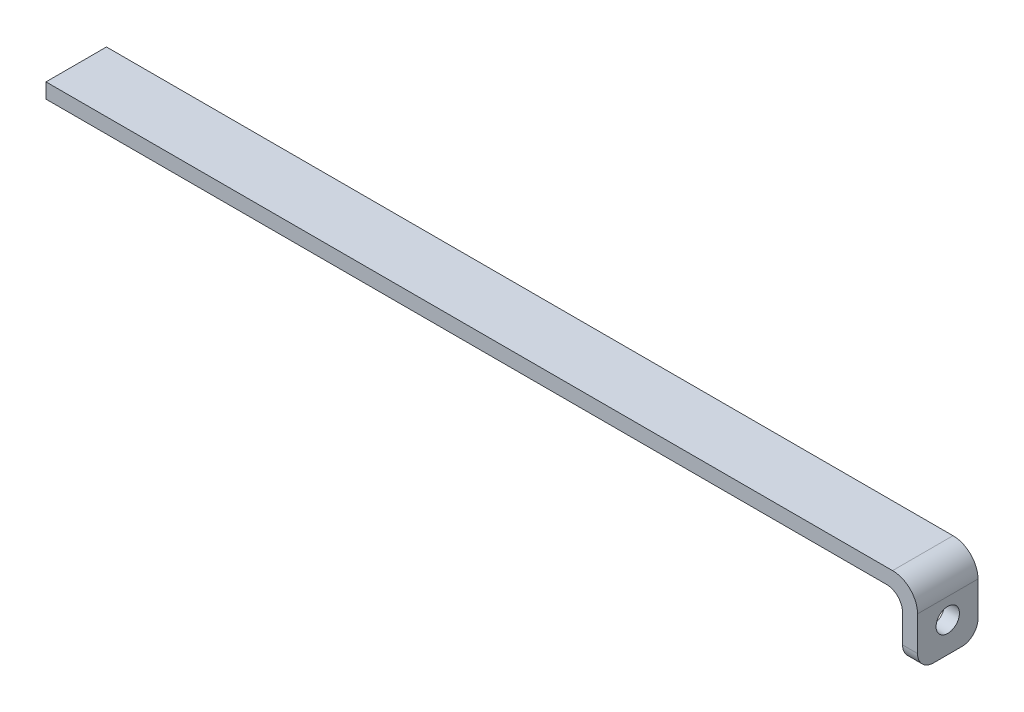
ISO-10303-21;
HEADER;
FILE_DESCRIPTION(('STEP AP214'),'2;1');
FILE_NAME('part.step','',(''),(''),'','','');
FILE_SCHEMA(('AUTOMOTIVE_DESIGN { 1 0 10303 214 1 1 1 1 }'));
ENDSEC;
DATA;
#1=APPLICATION_CONTEXT('core data for automotive mechanical design processes');
#2=APPLICATION_PROTOCOL_DEFINITION('international standard','automotive_design',2000,#1);
#3=PRODUCT_CONTEXT('',#1,'mechanical');
#4=PRODUCT('Part','Part','',(#3));
#5=PRODUCT_RELATED_PRODUCT_CATEGORY('part','',(#4));
#6=PRODUCT_DEFINITION_FORMATION('','',#4);
#7=PRODUCT_DEFINITION_CONTEXT('part definition',#1,'design');
#8=PRODUCT_DEFINITION('design','',#6,#7);
#9=PRODUCT_DEFINITION_SHAPE('','',#8);
#10=(LENGTH_UNIT() NAMED_UNIT(*) SI_UNIT(.MILLI.,.METRE.));
#11=(NAMED_UNIT(*) PLANE_ANGLE_UNIT() SI_UNIT($,.RADIAN.));
#12=(NAMED_UNIT(*) SI_UNIT($,.STERADIAN.) SOLID_ANGLE_UNIT());
#13=UNCERTAINTY_MEASURE_WITH_UNIT(LENGTH_MEASURE(1.E-05),#10,'distance_accuracy_value','');
#14=(GEOMETRIC_REPRESENTATION_CONTEXT(3) GLOBAL_UNCERTAINTY_ASSIGNED_CONTEXT((#13)) GLOBAL_UNIT_ASSIGNED_CONTEXT((#10,
#11,#12)) REPRESENTATION_CONTEXT('',''));
#15=CARTESIAN_POINT('',(0.,0.,0.));
#16=DIRECTION('',(0.,0.,1.));
#17=DIRECTION('',(1.,0.,0.));
#18=AXIS2_PLACEMENT_3D('',#15,#16,#17);
#19=CARTESIAN_POINT('',(-4.7625,-2.3622,4.7625));
#20=DIRECTION('',(-1.,0.,0.));
#21=DIRECTION('',(0.,0.,1.));
#22=AXIS2_PLACEMENT_3D('',#19,#20,#21);
#23=PLANE('',#22);
#24=DIRECTION('',(0.,0.,1.));
#25=VECTOR('',#24,1.);
#26=CARTESIAN_POINT('',(-4.7625,0.,4.7625));
#27=LINE('',#26,#25);
#28=CARTESIAN_POINT('',(-4.7625,0.,-4.7625));
#29=VERTEX_POINT('',#28);
#30=CARTESIAN_POINT('',(-4.7625,0.,4.7625));
#31=VERTEX_POINT('',#30);
#32=EDGE_CURVE('E141',#29,#31,#27,.T.);
#33=ORIENTED_EDGE('',*,*,#32,.F.);
#34=DIRECTION('',(0.,1.,0.));
#35=VECTOR('',#34,1.);
#36=CARTESIAN_POINT('',(-4.7625,-2.3622,-4.7625));
#37=LINE('',#36,#35);
#38=CARTESIAN_POINT('',(-4.7625,-2.3622,-4.7625));
#39=VERTEX_POINT('',#38);
#40=EDGE_CURVE('E120',#39,#29,#37,.T.);
#41=ORIENTED_EDGE('',*,*,#40,.F.);
#42=DIRECTION('',(0.,0.,1.));
#43=VECTOR('',#42,1.);
#44=CARTESIAN_POINT('',(-4.7625,-2.3622,4.7625));
#45=LINE('',#44,#43);
#46=CARTESIAN_POINT('',(-4.7625,-2.3622,4.7625));
#47=VERTEX_POINT('',#46);
#48=EDGE_CURVE('E127',#39,#47,#45,.T.);
#49=ORIENTED_EDGE('',*,*,#48,.T.);
#50=DIRECTION('',(0.,1.,0.));
#51=VECTOR('',#50,1.);
#52=CARTESIAN_POINT('',(-4.7625,-2.3622,4.7625));
#53=LINE('',#52,#51);
#54=EDGE_CURVE('E110',#47,#31,#53,.T.);
#55=ORIENTED_EDGE('',*,*,#54,.T.);
#56=EDGE_LOOP('',(#33,#41,#49,#55));
#57=FACE_BOUND('',#56,.T.);
#58=ADVANCED_FACE('F36',(#57),#23,.T.);
#59=CARTESIAN_POINT('',(-4.7625,-2.3622,-4.7625));
#60=DIRECTION('',(0.,0.,-1.));
#61=DIRECTION('',(-1.,0.,0.));
#62=AXIS2_PLACEMENT_3D('',#59,#60,#61);
#63=PLANE('',#62);
#64=DIRECTION('',(-1.,0.,0.));
#65=VECTOR('',#64,1.);
#66=CARTESIAN_POINT('',(-4.7625,0.,-4.7625));
#67=LINE('',#66,#65);
#68=CARTESIAN_POINT('',(128.5875,0.,-4.7625));
#69=VERTEX_POINT('',#68);
#70=EDGE_CURVE('E133',#69,#29,#67,.T.);
#71=ORIENTED_EDGE('',*,*,#70,.F.);
#72=CARTESIAN_POINT('',(128.5875,-3.937,-4.7625));
#73=DIRECTION('',(0.,0.,-1.));
#74=DIRECTION('',(-1.,0.,0.));
#75=AXIS2_PLACEMENT_3D('',#72,#73,#74);
#76=CIRCLE('',#75,3.937);
#77=CARTESIAN_POINT('',(132.5245,-3.937,-4.7625));
#78=VERTEX_POINT('',#77);
#79=EDGE_CURVE('E11',#69,#78,#76,.T.);
#80=ORIENTED_EDGE('',*,*,#79,.T.);
#81=DIRECTION('',(0.,1.,0.));
#82=VECTOR('',#81,1.);
#83=CARTESIAN_POINT('',(132.5245,0.,-4.7625));
#84=LINE('',#83,#82);
#85=CARTESIAN_POINT('',(132.5245,-9.3472,-4.7625));
#86=VERTEX_POINT('',#85);
#87=EDGE_CURVE('E143',#86,#78,#84,.T.);
#88=ORIENTED_EDGE('',*,*,#87,.F.);
#89=DIRECTION('',(-1.,0.,0.));
#90=VECTOR('',#89,1.);
#91=CARTESIAN_POINT('',(130.1623,-9.3472,-4.7625));
#92=LINE('',#91,#90);
#93=CARTESIAN_POINT('',(130.1623,-9.3472,-4.7625));
#94=VERTEX_POINT('',#93);
#95=EDGE_CURVE('E145',#86,#94,#92,.T.);
#96=ORIENTED_EDGE('',*,*,#95,.T.);
#97=DIRECTION('',(0.,1.,0.));
#98=VECTOR('',#97,1.);
#99=CARTESIAN_POINT('',(130.1623,0.,-4.7625));
#100=LINE('',#99,#98);
#101=CARTESIAN_POINT('',(130.1623,-4.9022,-4.7625));
#102=VERTEX_POINT('',#101);
#103=EDGE_CURVE('E137',#94,#102,#100,.T.);
#104=ORIENTED_EDGE('',*,*,#103,.T.);
#105=CARTESIAN_POINT('',(127.6223,-4.9022,-4.7625));
#106=DIRECTION('',(0.,0.,-1.));
#107=DIRECTION('',(-1.,0.,0.));
#108=AXIS2_PLACEMENT_3D('',#105,#106,#107);
#109=CIRCLE('',#108,2.54);
#110=CARTESIAN_POINT('',(127.6223,-2.3622,-4.7625));
#111=VERTEX_POINT('',#110);
#112=EDGE_CURVE('E169',#102,#111,#109,.F.);
#113=ORIENTED_EDGE('',*,*,#112,.T.);
#114=DIRECTION('',(-1.,0.,0.));
#115=VECTOR('',#114,1.);
#116=CARTESIAN_POINT('',(-4.7625,-2.3622,-4.7625));
#117=LINE('',#116,#115);
#118=EDGE_CURVE('E121',#111,#39,#117,.T.);
#119=ORIENTED_EDGE('',*,*,#118,.T.);
#120=ORIENTED_EDGE('',*,*,#40,.T.);
#121=EDGE_LOOP('',(#71,#80,#88,#96,#104,#113,#119,#120));
#122=FACE_BOUND('',#121,.T.);
#123=ADVANCED_FACE('F212',(#122),#63,.T.);
#124=CARTESIAN_POINT('',(-4.7625,-2.3622,4.7625));
#125=DIRECTION('',(0.,0.,1.));
#126=DIRECTION('',(1.,0.,0.));
#127=AXIS2_PLACEMENT_3D('',#124,#125,#126);
#128=PLANE('',#127);
#129=DIRECTION('',(0.,-1.,0.));
#130=VECTOR('',#129,1.);
#131=CARTESIAN_POINT('',(132.5245,0.,4.7625));
#132=LINE('',#131,#130);
#133=CARTESIAN_POINT('',(132.5245,-3.937,4.7625));
#134=VERTEX_POINT('',#133);
#135=CARTESIAN_POINT('',(132.5245,-9.3472,4.7625));
#136=VERTEX_POINT('',#135);
#137=EDGE_CURVE('E180',#134,#136,#132,.T.);
#138=ORIENTED_EDGE('',*,*,#137,.F.);
#139=CARTESIAN_POINT('',(128.5875,-3.937,4.7625));
#140=DIRECTION('',(0.,0.,1.));
#141=DIRECTION('',(1.,0.,0.));
#142=AXIS2_PLACEMENT_3D('',#139,#140,#141);
#143=CIRCLE('',#142,3.937);
#144=CARTESIAN_POINT('',(128.5875,0.,4.7625));
#145=VERTEX_POINT('',#144);
#146=EDGE_CURVE('E58',#134,#145,#143,.T.);
#147=ORIENTED_EDGE('',*,*,#146,.T.);
#148=DIRECTION('',(1.,0.,0.));
#149=VECTOR('',#148,1.);
#150=CARTESIAN_POINT('',(-4.7625,0.,4.7625));
#151=LINE('',#150,#149);
#152=EDGE_CURVE('E115',#31,#145,#151,.T.);
#153=ORIENTED_EDGE('',*,*,#152,.F.);
#154=ORIENTED_EDGE('',*,*,#54,.F.);
#155=DIRECTION('',(1.,0.,0.));
#156=VECTOR('',#155,1.);
#157=CARTESIAN_POINT('',(-4.7625,-2.3622,4.7625));
#158=LINE('',#157,#156);
#159=CARTESIAN_POINT('',(127.6223,-2.3622,4.7625));
#160=VERTEX_POINT('',#159);
#161=EDGE_CURVE('E113',#47,#160,#158,.T.);
#162=ORIENTED_EDGE('',*,*,#161,.T.);
#163=CARTESIAN_POINT('',(127.6223,-4.9022,4.7625));
#164=DIRECTION('',(0.,0.,1.));
#165=DIRECTION('',(1.,0.,0.));
#166=AXIS2_PLACEMENT_3D('',#163,#164,#165);
#167=CIRCLE('',#166,2.54);
#168=CARTESIAN_POINT('',(130.1623,-4.9022,4.7625));
#169=VERTEX_POINT('',#168);
#170=EDGE_CURVE('E171',#160,#169,#167,.F.);
#171=ORIENTED_EDGE('',*,*,#170,.T.);
#172=DIRECTION('',(0.,-1.,0.));
#173=VECTOR('',#172,1.);
#174=CARTESIAN_POINT('',(130.1623,0.,4.7625));
#175=LINE('',#174,#173);
#176=CARTESIAN_POINT('',(130.1623,-9.3472,4.7625));
#177=VERTEX_POINT('',#176);
#178=EDGE_CURVE('E198',#169,#177,#175,.T.);
#179=ORIENTED_EDGE('',*,*,#178,.T.);
#180=DIRECTION('',(-1.,0.,0.));
#181=VECTOR('',#180,1.);
#182=CARTESIAN_POINT('',(132.5245,-9.3472,4.7625));
#183=LINE('',#182,#181);
#184=EDGE_CURVE('E165',#177,#136,#183,.F.);
#185=ORIENTED_EDGE('',*,*,#184,.T.);
#186=EDGE_LOOP('',(#138,#147,#153,#154,#162,#171,#179,#185));
#187=FACE_BOUND('',#186,.T.);
#188=ADVANCED_FACE('F112',(#187),#128,.T.);
#189=CARTESIAN_POINT('',(0.,-2.3622,0.));
#190=DIRECTION('',(0.,-1.,0.));
#191=DIRECTION('',(0.,0.,-1.));
#192=AXIS2_PLACEMENT_3D('',#189,#190,#191);
#193=PLANE('',#192);
#194=ORIENTED_EDGE('',*,*,#118,.F.);
#195=DIRECTION('',(0.,0.,-1.));
#196=VECTOR('',#195,1.);
#197=CARTESIAN_POINT('',(127.6223,-2.3622,0.));
#198=LINE('',#197,#196);
#199=EDGE_CURVE('E129',#111,#160,#198,.F.);
#200=ORIENTED_EDGE('',*,*,#199,.T.);
#201=ORIENTED_EDGE('',*,*,#161,.F.);
#202=ORIENTED_EDGE('',*,*,#48,.F.);
#203=EDGE_LOOP('',(#194,#200,#201,#202));
#204=FACE_BOUND('',#203,.T.);
#205=ADVANCED_FACE('F126',(#204),#193,.T.);
#206=CARTESIAN_POINT('',(0.,0.,0.));
#207=DIRECTION('',(0.,-1.,0.));
#208=DIRECTION('',(0.,0.,-1.));
#209=AXIS2_PLACEMENT_3D('',#206,#207,#208);
#210=PLANE('',#209);
#211=ORIENTED_EDGE('',*,*,#152,.T.);
#212=DIRECTION('',(0.,0.,1.));
#213=VECTOR('',#212,1.);
#214=CARTESIAN_POINT('',(128.5875,0.,-4.7625));
#215=LINE('',#214,#213);
#216=EDGE_CURVE('E44',#145,#69,#215,.F.);
#217=ORIENTED_EDGE('',*,*,#216,.T.);
#218=ORIENTED_EDGE('',*,*,#70,.T.);
#219=ORIENTED_EDGE('',*,*,#32,.T.);
#220=EDGE_LOOP('',(#211,#217,#218,#219));
#221=FACE_BOUND('',#220,.T.);
#222=ADVANCED_FACE('F240',(#221),#210,.F.);
#223=CARTESIAN_POINT('',(130.1623,0.,0.));
#224=DIRECTION('',(1.,0.,0.));
#225=DIRECTION('',(0.,0.,-1.));
#226=AXIS2_PLACEMENT_3D('',#223,#224,#225);
#227=PLANE('',#226);
#228=CARTESIAN_POINT('',(130.1623,-7.1374,0.));
#229=DIRECTION('',(1.,0.,0.));
#230=DIRECTION('',(0.,0.,-1.));
#231=AXIS2_PLACEMENT_3D('',#228,#229,#230);
#232=CIRCLE('',#231,1.8415);
#233=CARTESIAN_POINT('',(130.1623,-7.1374,-1.8415));
#234=VERTEX_POINT('',#233);
#235=EDGE_CURVE('E194',#234,#234,#232,.T.);
#236=ORIENTED_EDGE('',*,*,#235,.T.);
#237=EDGE_LOOP('',(#236));
#238=FACE_BOUND('',#237,.T.);
#239=ORIENTED_EDGE('',*,*,#103,.F.);
#240=CARTESIAN_POINT('',(130.1623,-9.3472,-2.2225));
#241=DIRECTION('',(1.,0.,0.));
#242=DIRECTION('',(0.,0.,-1.));
#243=AXIS2_PLACEMENT_3D('',#240,#241,#242);
#244=CIRCLE('',#243,2.54);
#245=CARTESIAN_POINT('',(130.1623,-11.8872,-2.2225));
#246=VERTEX_POINT('',#245);
#247=EDGE_CURVE('E154',#94,#246,#244,.F.);
#248=ORIENTED_EDGE('',*,*,#247,.T.);
#249=DIRECTION('',(0.,0.,-1.));
#250=VECTOR('',#249,1.);
#251=CARTESIAN_POINT('',(130.1623,-11.8872,4.7625));
#252=LINE('',#251,#250);
#253=CARTESIAN_POINT('',(130.1623,-11.8872,2.2225));
#254=VERTEX_POINT('',#253);
#255=EDGE_CURVE('E192',#254,#246,#252,.T.);
#256=ORIENTED_EDGE('',*,*,#255,.F.);
#257=CARTESIAN_POINT('',(130.1623,-9.3472,2.2225));
#258=DIRECTION('',(1.,0.,0.));
#259=DIRECTION('',(0.,0.,-1.));
#260=AXIS2_PLACEMENT_3D('',#257,#258,#259);
#261=CIRCLE('',#260,2.54);
#262=EDGE_CURVE('E152',#254,#177,#261,.F.);
#263=ORIENTED_EDGE('',*,*,#262,.T.);
#264=ORIENTED_EDGE('',*,*,#178,.F.);
#265=DIRECTION('',(0.,0.,-1.));
#266=VECTOR('',#265,1.);
#267=CARTESIAN_POINT('',(130.1623,-4.9022,0.));
#268=LINE('',#267,#266);
#269=EDGE_CURVE('E149',#169,#102,#268,.T.);
#270=ORIENTED_EDGE('',*,*,#269,.T.);
#271=EDGE_LOOP('',(#239,#248,#256,#263,#264,#270));
#272=FACE_BOUND('',#271,.T.);
#273=ADVANCED_FACE('F238',(#238,#272),#227,.F.);
#274=CARTESIAN_POINT('',(132.5245,-11.8872,4.7625));
#275=DIRECTION('',(0.,1.,0.));
#276=DIRECTION('',(0.,0.,1.));
#277=AXIS2_PLACEMENT_3D('',#274,#275,#276);
#278=PLANE('',#277);
#279=ORIENTED_EDGE('',*,*,#255,.T.);
#280=DIRECTION('',(-1.,0.,0.));
#281=VECTOR('',#280,1.);
#282=CARTESIAN_POINT('',(132.5245,-11.8872,-2.2225));
#283=LINE('',#282,#281);
#284=CARTESIAN_POINT('',(132.5245,-11.8872,-2.2225));
#285=VERTEX_POINT('',#284);
#286=EDGE_CURVE('E159',#246,#285,#283,.F.);
#287=ORIENTED_EDGE('',*,*,#286,.T.);
#288=DIRECTION('',(0.,0.,-1.));
#289=VECTOR('',#288,1.);
#290=CARTESIAN_POINT('',(132.5245,-11.8872,4.7625));
#291=LINE('',#290,#289);
#292=CARTESIAN_POINT('',(132.5245,-11.8872,2.2225));
#293=VERTEX_POINT('',#292);
#294=EDGE_CURVE('E187',#293,#285,#291,.T.);
#295=ORIENTED_EDGE('',*,*,#294,.F.);
#296=DIRECTION('',(-1.,0.,0.));
#297=VECTOR('',#296,1.);
#298=CARTESIAN_POINT('',(130.1623,-11.8872,2.2225));
#299=LINE('',#298,#297);
#300=EDGE_CURVE('E156',#293,#254,#299,.T.);
#301=ORIENTED_EDGE('',*,*,#300,.T.);
#302=EDGE_LOOP('',(#279,#287,#295,#301));
#303=FACE_BOUND('',#302,.T.);
#304=ADVANCED_FACE('F203',(#303),#278,.F.);
#305=CARTESIAN_POINT('',(132.5245,0.,0.));
#306=DIRECTION('',(1.,0.,0.));
#307=DIRECTION('',(0.,0.,-1.));
#308=AXIS2_PLACEMENT_3D('',#305,#306,#307);
#309=PLANE('',#308);
#310=CARTESIAN_POINT('',(132.5245,-7.1374,0.));
#311=DIRECTION('',(1.,0.,0.));
#312=DIRECTION('',(0.,0.,-1.));
#313=AXIS2_PLACEMENT_3D('',#310,#311,#312);
#314=CIRCLE('',#313,1.8415);
#315=CARTESIAN_POINT('',(132.5245,-7.1374,-1.8415));
#316=VERTEX_POINT('',#315);
#317=EDGE_CURVE('E265',#316,#316,#314,.T.);
#318=ORIENTED_EDGE('',*,*,#317,.F.);
#319=EDGE_LOOP('',(#318));
#320=FACE_BOUND('',#319,.T.);
#321=ORIENTED_EDGE('',*,*,#87,.T.);
#322=DIRECTION('',(0.,0.,1.));
#323=VECTOR('',#322,1.);
#324=CARTESIAN_POINT('',(132.5245,-3.937,4.7625));
#325=LINE('',#324,#323);
#326=EDGE_CURVE('E173',#78,#134,#325,.T.);
#327=ORIENTED_EDGE('',*,*,#326,.T.);
#328=ORIENTED_EDGE('',*,*,#137,.T.);
#329=CARTESIAN_POINT('',(132.5245,-9.3472,2.2225));
#330=DIRECTION('',(1.,0.,0.));
#331=DIRECTION('',(0.,0.,-1.));
#332=AXIS2_PLACEMENT_3D('',#329,#330,#331);
#333=CIRCLE('',#332,2.54);
#334=EDGE_CURVE('E161',#136,#293,#333,.T.);
#335=ORIENTED_EDGE('',*,*,#334,.T.);
#336=ORIENTED_EDGE('',*,*,#294,.T.);
#337=CARTESIAN_POINT('',(132.5245,-9.3472,-2.2225));
#338=DIRECTION('',(1.,0.,0.));
#339=DIRECTION('',(0.,0.,-1.));
#340=AXIS2_PLACEMENT_3D('',#337,#338,#339);
#341=CIRCLE('',#340,2.54);
#342=EDGE_CURVE('E163',#285,#86,#341,.T.);
#343=ORIENTED_EDGE('',*,*,#342,.T.);
#344=EDGE_LOOP('',(#321,#327,#328,#335,#336,#343));
#345=FACE_BOUND('',#344,.T.);
#346=ADVANCED_FACE('F179',(#320,#345),#309,.T.);
#347=CARTESIAN_POINT('',(-4.7625,-7.1374,0.));
#348=DIRECTION('',(1.,0.,0.));
#349=DIRECTION('',(0.,0.,-1.));
#350=AXIS2_PLACEMENT_3D('',#347,#348,#349);
#351=CYLINDRICAL_SURFACE('',#350,1.8415);
#352=ORIENTED_EDGE('',*,*,#317,.T.);
#353=EDGE_LOOP('',(#352));
#354=FACE_BOUND('',#353,.T.);
#355=ORIENTED_EDGE('',*,*,#235,.F.);
#356=EDGE_LOOP('',(#355));
#357=FACE_BOUND('',#356,.T.);
#358=ADVANCED_FACE('F232',(#354,#357),#351,.F.);
#359=CARTESIAN_POINT('',(-4.7625,-9.3472,-2.2225));
#360=DIRECTION('',(1.,0.,0.));
#361=DIRECTION('',(0.,0.,-1.));
#362=AXIS2_PLACEMENT_3D('',#359,#360,#361);
#363=CYLINDRICAL_SURFACE('',#362,2.54);
#364=ORIENTED_EDGE('',*,*,#342,.F.);
#365=ORIENTED_EDGE('',*,*,#286,.F.);
#366=ORIENTED_EDGE('',*,*,#247,.F.);
#367=ORIENTED_EDGE('',*,*,#95,.F.);
#368=EDGE_LOOP('',(#364,#365,#366,#367));
#369=FACE_BOUND('',#368,.T.);
#370=ADVANCED_FACE('F209',(#369),#363,.T.);
#371=CARTESIAN_POINT('',(132.5245,-9.3472,2.2225));
#372=DIRECTION('',(1.,0.,0.));
#373=DIRECTION('',(0.,0.,-1.));
#374=AXIS2_PLACEMENT_3D('',#371,#372,#373);
#375=CYLINDRICAL_SURFACE('',#374,2.54);
#376=ORIENTED_EDGE('',*,*,#334,.F.);
#377=ORIENTED_EDGE('',*,*,#184,.F.);
#378=ORIENTED_EDGE('',*,*,#262,.F.);
#379=ORIENTED_EDGE('',*,*,#300,.F.);
#380=EDGE_LOOP('',(#376,#377,#378,#379));
#381=FACE_BOUND('',#380,.T.);
#382=ADVANCED_FACE('F219',(#381),#375,.T.);
#383=CARTESIAN_POINT('',(127.6223,-4.9022,0.));
#384=DIRECTION('',(0.,0.,-1.));
#385=DIRECTION('',(-1.,0.,0.));
#386=AXIS2_PLACEMENT_3D('',#383,#384,#385);
#387=CYLINDRICAL_SURFACE('',#386,2.54);
#388=ORIENTED_EDGE('',*,*,#170,.F.);
#389=ORIENTED_EDGE('',*,*,#199,.F.);
#390=ORIENTED_EDGE('',*,*,#112,.F.);
#391=ORIENTED_EDGE('',*,*,#269,.F.);
#392=EDGE_LOOP('',(#388,#389,#390,#391));
#393=FACE_BOUND('',#392,.T.);
#394=ADVANCED_FACE('F215',(#393),#387,.F.);
#395=CARTESIAN_POINT('',(128.5875,-3.937,0.));
#396=DIRECTION('',(0.,0.,-1.));
#397=DIRECTION('',(-1.,0.,0.));
#398=AXIS2_PLACEMENT_3D('',#395,#396,#397);
#399=CYLINDRICAL_SURFACE('',#398,3.937);
#400=ORIENTED_EDGE('',*,*,#79,.F.);
#401=ORIENTED_EDGE('',*,*,#216,.F.);
#402=ORIENTED_EDGE('',*,*,#146,.F.);
#403=ORIENTED_EDGE('',*,*,#326,.F.);
#404=EDGE_LOOP('',(#400,#401,#402,#403));
#405=FACE_BOUND('',#404,.T.);
#406=ADVANCED_FACE('F38',(#405),#399,.T.);
#407=CLOSED_SHELL('',(#58,#123,#188,#205,#222,#273,#304,#346,#358,#370,#382,#394,#406));
#408=MANIFOLD_SOLID_BREP('B2',#407);
#409=ADVANCED_BREP_SHAPE_REPRESENTATION('',(#18,#408),#14);
#410=SHAPE_DEFINITION_REPRESENTATION(#9,#409);
ENDSEC;
END-ISO-10303-21;
